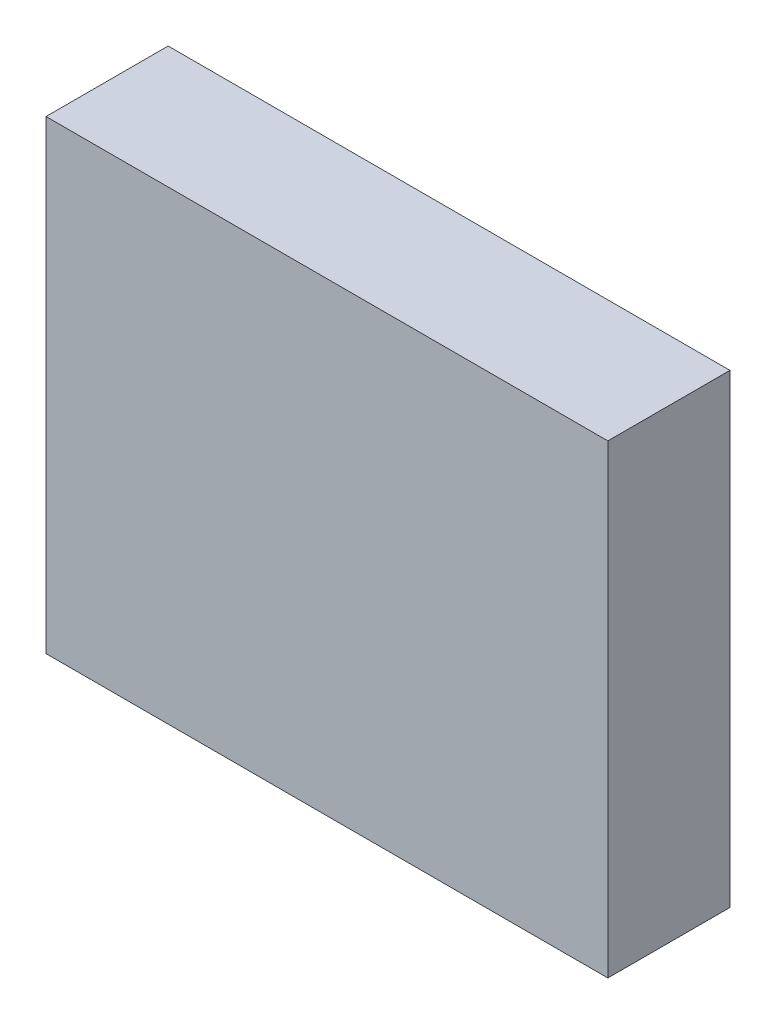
from build123d import *

# Parameters (mm, degrees)
SKETCH1_W      = 92.007854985
SKETCH1_H      = 76.18081571
EXTRUDE1_DEPTH = 10


with BuildPart() as part:
    # Sketch1 → Extrude1 (new, symmetric)
    with BuildSketch(Plane.XY):
        with Locations((46.003927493, 38.090407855)):
            Rectangle(SKETCH1_W, SKETCH1_H)
    extrude(amount=EXTRUDE1_DEPTH, both=True)


solid = part.part
